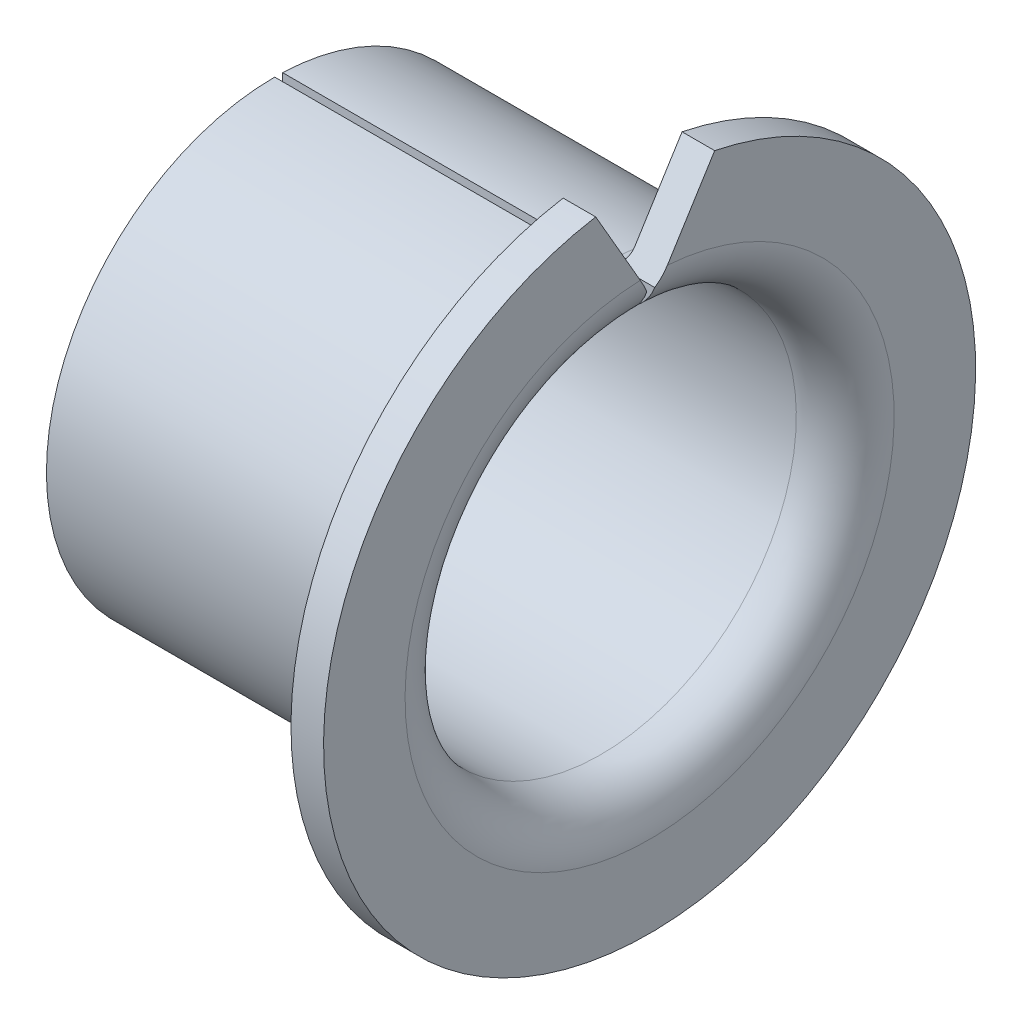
ISO-10303-21;
HEADER;
FILE_DESCRIPTION(('STEP AP214'),'2;1');
FILE_NAME('part.step','',(''),(''),'','','');
FILE_SCHEMA(('AUTOMOTIVE_DESIGN { 1 0 10303 214 1 1 1 1 }'));
ENDSEC;
DATA;
#1=APPLICATION_CONTEXT('core data for automotive mechanical design processes');
#2=APPLICATION_PROTOCOL_DEFINITION('international standard','automotive_design',2000,#1);
#3=PRODUCT_CONTEXT('',#1,'mechanical');
#4=PRODUCT('Part','Part','',(#3));
#5=PRODUCT_RELATED_PRODUCT_CATEGORY('part','',(#4));
#6=PRODUCT_DEFINITION_FORMATION('','',#4);
#7=PRODUCT_DEFINITION_CONTEXT('part definition',#1,'design');
#8=PRODUCT_DEFINITION('design','',#6,#7);
#9=PRODUCT_DEFINITION_SHAPE('','',#8);
#10=(LENGTH_UNIT() NAMED_UNIT(*) SI_UNIT(.MILLI.,.METRE.));
#11=(NAMED_UNIT(*) PLANE_ANGLE_UNIT() SI_UNIT($,.RADIAN.));
#12=(NAMED_UNIT(*) SI_UNIT($,.STERADIAN.) SOLID_ANGLE_UNIT());
#13=UNCERTAINTY_MEASURE_WITH_UNIT(LENGTH_MEASURE(1.E-05),#10,'distance_accuracy_value','');
#14=(GEOMETRIC_REPRESENTATION_CONTEXT(3) GLOBAL_UNCERTAINTY_ASSIGNED_CONTEXT((#13)) GLOBAL_UNIT_ASSIGNED_CONTEXT((#10,
#11,#12)) REPRESENTATION_CONTEXT('',''));
#15=CARTESIAN_POINT('',(0.,0.,0.));
#16=DIRECTION('',(0.,0.,1.));
#17=DIRECTION('',(1.,0.,0.));
#18=AXIS2_PLACEMENT_3D('',#15,#16,#17);
#19=CARTESIAN_POINT('',(10.,0.,0.));
#20=DIRECTION('',(-1.,0.,0.));
#21=DIRECTION('',(0.,0.,1.));
#22=AXIS2_PLACEMENT_3D('',#19,#20,#21);
#23=TOROIDAL_SURFACE('',#22,7.5,1.5);
#24=CARTESIAN_POINT('',(11.499988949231,7.5002,0.288790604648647));
#25=CARTESIAN_POINT('',(11.5001546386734,7.45775465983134,0.264284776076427));
#26=CARTESIAN_POINT('',(11.4984413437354,7.41531521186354,0.239782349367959));
#27=CARTESIAN_POINT('',(11.4913330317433,7.33090663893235,0.191049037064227));
#28=CARTESIAN_POINT('',(11.485958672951,7.28893621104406,0.166817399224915));
#29=CARTESIAN_POINT('',(11.4643997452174,7.16353320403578,0.0944159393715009));
#30=CARTESIAN_POINT('',(11.4427791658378,7.08077743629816,0.0466368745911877));
#31=CARTESIAN_POINT('',(11.4141428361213,6.99980000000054,-0.000115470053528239));
#32=B_SPLINE_CURVE_WITH_KNOTS('',3,(#24,#25,#26,#27,#28,#29,#30,#31),.UNSPECIFIED.,.F.,.F.,(4,2,
2,4),(0.,0.146975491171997,0.293128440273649,0.58601194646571),.UNSPECIFIED.);
#33=CARTESIAN_POINT('',(11.5,7.49456264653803,0.285535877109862));
#34=VERTEX_POINT('',#33);
#35=CARTESIAN_POINT('',(11.4142135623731,7.,0.));
#36=VERTEX_POINT('',#35);
#37=EDGE_CURVE('E40',#34,#36,#32,.T.);
#38=ORIENTED_EDGE('',*,*,#37,.F.);
#39=CARTESIAN_POINT('',(11.5,0.,0.));
#40=DIRECTION('',(-1.,0.,0.));
#41=DIRECTION('',(0.,0.,1.));
#42=AXIS2_PLACEMENT_3D('',#39,#40,#41);
#43=CIRCLE('',#42,7.5);
#44=CARTESIAN_POINT('',(11.5,7.48003210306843,-0.546918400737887));
#45=VERTEX_POINT('',#44);
#46=EDGE_CURVE('E113',#45,#34,#43,.T.);
#47=ORIENTED_EDGE('',*,*,#46,.F.);
#48=CARTESIAN_POINT('',(11.414141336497,6.99553578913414,-0.244171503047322));
#49=CARTESIAN_POINT('',(11.4436225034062,7.07717137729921,-0.295183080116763));
#50=CARTESIAN_POINT('',(11.4656674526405,7.16065124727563,-0.347347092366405));
#51=CARTESIAN_POINT('',(11.4872021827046,7.28714152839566,-0.426386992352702));
#52=CARTESIAN_POINT('',(11.4924588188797,7.32947172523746,-0.452837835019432));
#53=CARTESIAN_POINT('',(11.499108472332,7.41460324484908,-0.506033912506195));
#54=CARTESIAN_POINT('',(11.5004782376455,7.45740587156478,-0.532779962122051));
#55=CARTESIAN_POINT('',(11.499852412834,7.5002,-0.559520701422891));
#56=B_SPLINE_CURVE_WITH_KNOTS('',3,(#48,#49,#50,#51,#52,#53,#54,#55),.UNSPECIFIED.,.F.,.F.,(4,2,
2,4),(0.,0.301494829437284,0.451927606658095,0.60325842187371),.UNSPECIFIED.);
#57=CARTESIAN_POINT('',(11.4142135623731,6.99573578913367,-0.244296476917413));
#58=VERTEX_POINT('',#57);
#59=EDGE_CURVE('E143',#58,#45,#56,.T.);
#60=ORIENTED_EDGE('',*,*,#59,.F.);
#61=CARTESIAN_POINT('',(10.,7.49543120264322,-0.261746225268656));
#62=DIRECTION('',(0.,0.0348994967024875,0.999390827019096));
#63=DIRECTION('',(1.,0.,0.));
#64=AXIS2_PLACEMENT_3D('',#61,#62,#63);
#65=CIRCLE('',#64,1.5);
#66=CARTESIAN_POINT('',(10.,5.99634496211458,-0.209396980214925));
#67=VERTEX_POINT('',#66);
#68=EDGE_CURVE('E157',#67,#58,#65,.T.);
#69=ORIENTED_EDGE('',*,*,#68,.F.);
#70=CARTESIAN_POINT('',(10.,0.,0.));
#71=DIRECTION('',(-1.,0.,0.));
#72=DIRECTION('',(0.,0.,1.));
#73=AXIS2_PLACEMENT_3D('',#70,#71,#72);
#74=CIRCLE('',#73,6.);
#75=CARTESIAN_POINT('',(10.,6.,0.));
#76=VERTEX_POINT('',#75);
#77=EDGE_CURVE('E121',#67,#76,#74,.T.);
#78=ORIENTED_EDGE('',*,*,#77,.T.);
#79=CARTESIAN_POINT('',(10.,7.5,0.));
#80=DIRECTION('',(0.,0.,1.));
#81=DIRECTION('',(1.,0.,0.));
#82=AXIS2_PLACEMENT_3D('',#79,#80,#81);
#83=CIRCLE('',#82,1.5);
#84=EDGE_CURVE('E147',#76,#36,#83,.T.);
#85=ORIENTED_EDGE('',*,*,#84,.T.);
#86=EDGE_LOOP('',(#38,#47,#60,#69,#78,#85));
#87=FACE_BOUND('',#86,.T.);
#88=ADVANCED_FACE('F26',(#87),#23,.T.);
#89=CARTESIAN_POINT('',(11.5,9.99390827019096,-0.348994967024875));
#90=DIRECTION('',(-1.,0.,0.));
#91=DIRECTION('',(0.,0.,1.));
#92=AXIS2_PLACEMENT_3D('',#89,#90,#91);
#93=PLANE('',#92);
#94=DIRECTION('',(0.,-0.866025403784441,-0.499999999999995));
#95=VECTOR('',#94,1.);
#96=CARTESIAN_POINT('',(11.5,7.,0.));
#97=LINE('',#96,#95);
#98=CARTESIAN_POINT('',(11.5,9.86249036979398,1.65265958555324));
#99=VERTEX_POINT('',#98);
#100=EDGE_CURVE('E98',#99,#34,#97,.T.);
#101=ORIENTED_EDGE('',*,*,#100,.F.);
#102=CARTESIAN_POINT('',(11.5,0.,0.));
#103=DIRECTION('',(-1.,0.,0.));
#104=DIRECTION('',(0.,0.,1.));
#105=AXIS2_PLACEMENT_3D('',#102,#103,#104);
#106=CIRCLE('',#105,10.);
#107=CARTESIAN_POINT('',(11.5,9.79880541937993,-1.99584878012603));
#108=VERTEX_POINT('',#107);
#109=EDGE_CURVE('E111',#108,#99,#106,.T.);
#110=ORIENTED_EDGE('',*,*,#109,.F.);
#111=DIRECTION('',(0.,0.848048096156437,-0.529919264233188));
#112=VECTOR('',#111,1.);
#113=CARTESIAN_POINT('',(11.5,6.99573578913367,-0.244296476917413));
#114=LINE('',#113,#112);
#115=EDGE_CURVE('E114',#45,#108,#114,.T.);
#116=ORIENTED_EDGE('',*,*,#115,.F.);
#117=ORIENTED_EDGE('',*,*,#46,.T.);
#118=EDGE_LOOP('',(#101,#110,#116,#117));
#119=FACE_BOUND('',#118,.T.);
#120=ADVANCED_FACE('F109',(#119),#93,.F.);
#121=CARTESIAN_POINT('',(0.,0.,0.));
#122=DIRECTION('',(-1.,0.,0.));
#123=DIRECTION('',(0.,0.,1.));
#124=AXIS2_PLACEMENT_3D('',#121,#122,#123);
#125=CYLINDRICAL_SURFACE('',#124,10.);
#126=DIRECTION('',(-1.,0.,0.));
#127=VECTOR('',#126,1.);
#128=CARTESIAN_POINT('',(0.,9.86249036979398,1.65265958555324));
#129=LINE('',#128,#127);
#130=CARTESIAN_POINT('',(10.5,9.86249036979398,1.65265958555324));
#131=VERTEX_POINT('',#130);
#132=EDGE_CURVE('E95',#131,#99,#129,.F.);
#133=ORIENTED_EDGE('',*,*,#132,.F.);
#134=CARTESIAN_POINT('',(10.5,0.,0.));
#135=DIRECTION('',(-1.,0.,0.));
#136=DIRECTION('',(0.,0.,1.));
#137=AXIS2_PLACEMENT_3D('',#134,#135,#136);
#138=CIRCLE('',#137,10.);
#139=CARTESIAN_POINT('',(10.5,9.79880541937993,-1.99584878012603));
#140=VERTEX_POINT('',#139);
#141=EDGE_CURVE('E119',#140,#131,#138,.T.);
#142=ORIENTED_EDGE('',*,*,#141,.F.);
#143=DIRECTION('',(-1.,0.,0.));
#144=VECTOR('',#143,1.);
#145=CARTESIAN_POINT('',(0.,9.79880541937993,-1.99584878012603));
#146=LINE('',#145,#144);
#147=EDGE_CURVE('E118',#108,#140,#146,.T.);
#148=ORIENTED_EDGE('',*,*,#147,.F.);
#149=ORIENTED_EDGE('',*,*,#109,.T.);
#150=EDGE_LOOP('',(#133,#142,#148,#149));
#151=FACE_BOUND('',#150,.T.);
#152=ADVANCED_FACE('F117',(#151),#125,.T.);
#153=CARTESIAN_POINT('',(10.5,7.49543120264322,-0.261746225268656));
#154=DIRECTION('',(1.,0.,0.));
#155=DIRECTION('',(0.,0.,-1.));
#156=AXIS2_PLACEMENT_3D('',#153,#154,#155);
#157=PLANE('',#156);
#158=DIRECTION('',(0.,0.866025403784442,0.499999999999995));
#159=VECTOR('',#158,1.);
#160=CARTESIAN_POINT('',(10.5,7.25823396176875,0.149091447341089));
#161=LINE('',#160,#159);
#162=CARTESIAN_POINT('',(10.5,7.49456264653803,0.285535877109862));
#163=VERTEX_POINT('',#162);
#164=EDGE_CURVE('E100',#163,#131,#161,.T.);
#165=ORIENTED_EDGE('',*,*,#164,.F.);
#166=CARTESIAN_POINT('',(10.5,0.,0.));
#167=DIRECTION('',(-1.,0.,0.));
#168=DIRECTION('',(0.,0.,1.));
#169=AXIS2_PLACEMENT_3D('',#166,#167,#168);
#170=CIRCLE('',#169,7.5);
#171=CARTESIAN_POINT('',(10.5,7.48003210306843,-0.546918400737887));
#172=VERTEX_POINT('',#171);
#173=EDGE_CURVE('E123',#172,#163,#170,.T.);
#174=ORIENTED_EDGE('',*,*,#173,.F.);
#175=DIRECTION('',(0.,-0.848048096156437,0.529919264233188));
#176=VECTOR('',#175,1.);
#177=CARTESIAN_POINT('',(10.5,7.36295138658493,-0.473758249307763));
#178=LINE('',#177,#176);
#179=EDGE_CURVE('E178',#140,#172,#178,.T.);
#180=ORIENTED_EDGE('',*,*,#179,.F.);
#181=ORIENTED_EDGE('',*,*,#141,.T.);
#182=EDGE_LOOP('',(#165,#174,#180,#181));
#183=FACE_BOUND('',#182,.T.);
#184=ADVANCED_FACE('F177',(#183),#157,.F.);
#185=CARTESIAN_POINT('',(10.,0.,0.));
#186=DIRECTION('',(-1.,0.,0.));
#187=DIRECTION('',(0.,0.,1.));
#188=AXIS2_PLACEMENT_3D('',#185,#186,#187);
#189=TOROIDAL_SURFACE('',#188,7.5,0.5);
#190=CARTESIAN_POINT('',(9.9998,7.00000004,2.30940116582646E-08));
#191=CARTESIAN_POINT('',(10.0253037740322,6.9999557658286,-2.55386107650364E-05));
#192=CARTESIAN_POINT('',(10.0507781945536,7.00192858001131,0.00111346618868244));
#193=CARTESIAN_POINT('',(10.1008452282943,7.00963144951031,0.00556071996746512));
#194=CARTESIAN_POINT('',(10.1254412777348,7.01534465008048,0.00885923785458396));
#195=CARTESIAN_POINT('',(10.1731468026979,7.0302486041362,0.0174640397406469));
#196=CARTESIAN_POINT('',(10.1962576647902,7.03943605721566,0.0227684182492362));
#197=CARTESIAN_POINT('',(10.2405131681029,7.06087220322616,0.0351445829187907));
#198=CARTESIAN_POINT('',(10.261656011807,7.07312365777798,0.0422179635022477));
#199=CARTESIAN_POINT('',(10.3026632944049,7.10096232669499,0.0582906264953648));
#200=CARTESIAN_POINT('',(10.3223959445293,7.11669456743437,0.0673736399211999));
#201=CARTESIAN_POINT('',(10.3589487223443,7.15050866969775,0.0868962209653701));
#202=CARTESIAN_POINT('',(10.3757681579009,7.16859108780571,0.0973361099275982));
#203=CARTESIAN_POINT('',(10.4082661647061,7.20903080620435,0.120683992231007));
#204=CARTESIAN_POINT('',(10.4235278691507,7.23163932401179,0.133737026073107));
#205=CARTESIAN_POINT('',(10.4499935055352,7.27858501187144,0.160841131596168));
#206=CARTESIAN_POINT('',(10.4611934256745,7.30292386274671,0.174893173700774));
#207=CARTESIAN_POINT('',(10.480498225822,7.35565411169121,0.205336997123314));
#208=CARTESIAN_POINT('',(10.4880892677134,7.38418694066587,0.221810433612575));
#209=CARTESIAN_POINT('',(10.4979940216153,7.44189175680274,0.255126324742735));
#210=CARTESIAN_POINT('',(10.5003150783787,7.47106279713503,0.271968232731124));
#211=CARTESIAN_POINT('',(10.4999668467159,7.5002,0.288790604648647));
#212=B_SPLINE_CURVE_WITH_KNOTS('',3,(#190,#191,#192,#193,#194,#195,#196,#197,#198,#199,#200,
#201,#202,#203,#204,#205,#206,#207,#208,#209,#210,#211),.UNSPECIFIED.,.F.,.F.,(4,2,2,2,2,2,2,2,
2,2,4),(0.,0.0763609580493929,0.152380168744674,0.228327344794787,0.304343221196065,
0.384487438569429,0.464650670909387,0.555004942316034,0.645448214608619,0.746448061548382,
0.847307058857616),.UNSPECIFIED.);
#213=CARTESIAN_POINT('',(10.,7.,0.));
#214=VERTEX_POINT('',#213);
#215=EDGE_CURVE('E173',#214,#163,#212,.T.);
#216=ORIENTED_EDGE('',*,*,#215,.F.);
#217=CARTESIAN_POINT('',(10.,0.,0.));
#218=DIRECTION('',(-1.,0.,0.));
#219=DIRECTION('',(0.,0.,1.));
#220=AXIS2_PLACEMENT_3D('',#217,#218,#219);
#221=CIRCLE('',#220,7.);
#222=CARTESIAN_POINT('',(10.,6.99573578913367,-0.244296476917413));
#223=VERTEX_POINT('',#222);
#224=EDGE_CURVE('E164',#223,#214,#221,.T.);
#225=ORIENTED_EDGE('',*,*,#224,.F.);
#226=CARTESIAN_POINT('',(10.4995570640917,7.5002,-0.55952070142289));
#227=CARTESIAN_POINT('',(10.5008895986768,7.46999372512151,-0.540645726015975));
#228=CARTESIAN_POINT('',(10.4992247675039,7.43968930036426,-0.521709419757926));
#229=CARTESIAN_POINT('',(10.4899775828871,7.37965443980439,-0.484195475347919));
#230=CARTESIAN_POINT('',(10.482379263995,7.34992577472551,-0.465618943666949));
#231=CARTESIAN_POINT('',(10.4613242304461,7.29195252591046,-0.429393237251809));
#232=CARTESIAN_POINT('',(10.4478609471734,7.26370964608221,-0.411745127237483));
#233=CARTESIAN_POINT('',(10.4152284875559,7.20970885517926,-0.378001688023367));
#234=CARTESIAN_POINT('',(10.3960642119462,7.18394883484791,-0.361905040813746));
#235=CARTESIAN_POINT('',(10.3535175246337,7.13729934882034,-0.332755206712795));
#236=CARTESIAN_POINT('',(10.3304275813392,7.1162191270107,-0.319582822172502));
#237=CARTESIAN_POINT('',(10.2798413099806,7.07825073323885,-0.295857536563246));
#238=CARTESIAN_POINT('',(10.2523481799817,7.06135954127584,-0.285302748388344));
#239=CARTESIAN_POINT('',(10.1976151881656,7.03470319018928,-0.268646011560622));
#240=CARTESIAN_POINT('',(10.1708096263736,7.02429608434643,-0.262142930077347));
#241=CARTESIAN_POINT('',(10.1153511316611,7.0081054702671,-0.25202591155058));
#242=CARTESIAN_POINT('',(10.0867034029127,7.0023095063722,-0.248404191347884));
#243=CARTESIAN_POINT('',(10.0481078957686,6.99791429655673,-0.24565775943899));
#244=CARTESIAN_POINT('',(10.0384654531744,6.99709432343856,-0.245145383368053));
#245=CARTESIAN_POINT('',(10.01915045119,6.99600391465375,-0.244464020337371));
#246=CARTESIAN_POINT('',(10.0094779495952,6.99573274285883,-0.244294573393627));
#247=CARTESIAN_POINT('',(9.9998,6.99573582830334,-0.244296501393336));
#248=B_SPLINE_CURVE_WITH_KNOTS('',3,(#226,#227,#228,#229,#230,#231,#232,#233,#234,#235,#236,
#237,#238,#239,#240,#241,#242,#243,#244,#245,#246,#247),.UNSPECIFIED.,.F.,.F.,(4,2,2,2,2,2,2,2,
2,2,4),(0.,0.106815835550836,0.213920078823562,0.321144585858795,0.428277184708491,
0.529475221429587,0.630600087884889,0.71854077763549,0.806243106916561,0.835299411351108,
0.864316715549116),.UNSPECIFIED.);
#249=EDGE_CURVE('E174',#172,#223,#248,.T.);
#250=ORIENTED_EDGE('',*,*,#249,.F.);
#251=ORIENTED_EDGE('',*,*,#173,.T.);
#252=EDGE_LOOP('',(#216,#225,#250,#251));
#253=FACE_BOUND('',#252,.T.);
#254=ADVANCED_FACE('F171',(#253),#189,.F.);
#255=CARTESIAN_POINT('',(10.,7.49543120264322,-0.261746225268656));
#256=DIRECTION('',(0.,0.0348994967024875,0.999390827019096));
#257=DIRECTION('',(1.,0.,0.));
#258=AXIS2_PLACEMENT_3D('',#255,#256,#257);
#259=PLANE('',#258);
#260=ORIENTED_EDGE('',*,*,#68,.T.);
#261=DIRECTION('',(-1.,0.,0.));
#262=VECTOR('',#261,1.);
#263=CARTESIAN_POINT('',(11.5,6.99573578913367,-0.244296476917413));
#264=LINE('',#263,#262);
#265=EDGE_CURVE('E180',#58,#223,#264,.T.);
#266=ORIENTED_EDGE('',*,*,#265,.T.);
#267=DIRECTION('',(-1.,0.,0.));
#268=VECTOR('',#267,1.);
#269=CARTESIAN_POINT('',(0.,6.99573578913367,-0.244296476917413));
#270=LINE('',#269,#268);
#271=CARTESIAN_POINT('',(0.,6.99573578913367,-0.244296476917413));
#272=VERTEX_POINT('',#271);
#273=EDGE_CURVE('E160',#223,#272,#270,.T.);
#274=ORIENTED_EDGE('',*,*,#273,.T.);
#275=DIRECTION('',(0.,-0.999390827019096,0.0348994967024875));
#276=VECTOR('',#275,1.);
#277=CARTESIAN_POINT('',(0.,6.99573578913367,-0.244296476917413));
#278=LINE('',#277,#276);
#279=CARTESIAN_POINT('',(0.,5.99634496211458,-0.209396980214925));
#280=VERTEX_POINT('',#279);
#281=EDGE_CURVE('E154',#272,#280,#278,.T.);
#282=ORIENTED_EDGE('',*,*,#281,.T.);
#283=DIRECTION('',(1.,0.,0.));
#284=VECTOR('',#283,1.);
#285=CARTESIAN_POINT('',(0.,5.99634496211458,-0.209396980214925));
#286=LINE('',#285,#284);
#287=EDGE_CURVE('E135',#280,#67,#286,.T.);
#288=ORIENTED_EDGE('',*,*,#287,.T.);
#289=EDGE_LOOP('',(#260,#266,#274,#282,#288));
#290=FACE_BOUND('',#289,.T.);
#291=ADVANCED_FACE('F209',(#290),#259,.T.);
#292=CARTESIAN_POINT('',(10.,7.5,0.));
#293=DIRECTION('',(0.,0.,1.));
#294=DIRECTION('',(1.,0.,0.));
#295=AXIS2_PLACEMENT_3D('',#292,#293,#294);
#296=PLANE('',#295);
#297=DIRECTION('',(-1.,0.,0.));
#298=VECTOR('',#297,1.);
#299=CARTESIAN_POINT('',(10.,7.,0.));
#300=LINE('',#299,#298);
#301=EDGE_CURVE('E11',#36,#214,#300,.T.);
#302=ORIENTED_EDGE('',*,*,#301,.F.);
#303=ORIENTED_EDGE('',*,*,#84,.F.);
#304=DIRECTION('',(1.,0.,0.));
#305=VECTOR('',#304,1.);
#306=CARTESIAN_POINT('',(0.,6.,0.));
#307=LINE('',#306,#305);
#308=CARTESIAN_POINT('',(0.,6.,0.));
#309=VERTEX_POINT('',#308);
#310=EDGE_CURVE('E132',#309,#76,#307,.T.);
#311=ORIENTED_EDGE('',*,*,#310,.F.);
#312=DIRECTION('',(0.,-1.,0.));
#313=VECTOR('',#312,1.);
#314=CARTESIAN_POINT('',(0.,7.,0.));
#315=LINE('',#314,#313);
#316=CARTESIAN_POINT('',(0.,7.,0.));
#317=VERTEX_POINT('',#316);
#318=EDGE_CURVE('E139',#317,#309,#315,.T.);
#319=ORIENTED_EDGE('',*,*,#318,.F.);
#320=DIRECTION('',(-1.,0.,0.));
#321=VECTOR('',#320,1.);
#322=CARTESIAN_POINT('',(0.,7.,0.));
#323=LINE('',#322,#321);
#324=EDGE_CURVE('E149',#214,#317,#323,.T.);
#325=ORIENTED_EDGE('',*,*,#324,.F.);
#326=EDGE_LOOP('',(#302,#303,#311,#319,#325));
#327=FACE_BOUND('',#326,.T.);
#328=ADVANCED_FACE('F145',(#327),#296,.F.);
#329=CARTESIAN_POINT('',(0.,6.99573578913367,-0.244296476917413));
#330=DIRECTION('',(1.,0.,0.));
#331=DIRECTION('',(0.,0.,-1.));
#332=AXIS2_PLACEMENT_3D('',#329,#330,#331);
#333=PLANE('',#332);
#334=CARTESIAN_POINT('',(0.,0.,0.));
#335=DIRECTION('',(-1.,0.,0.));
#336=DIRECTION('',(0.,0.,1.));
#337=AXIS2_PLACEMENT_3D('',#334,#335,#336);
#338=CIRCLE('',#337,6.);
#339=EDGE_CURVE('E34',#280,#309,#338,.T.);
#340=ORIENTED_EDGE('',*,*,#339,.F.);
#341=ORIENTED_EDGE('',*,*,#281,.F.);
#342=CARTESIAN_POINT('',(0.,0.,0.));
#343=DIRECTION('',(-1.,0.,0.));
#344=DIRECTION('',(0.,0.,1.));
#345=AXIS2_PLACEMENT_3D('',#342,#343,#344);
#346=CIRCLE('',#345,7.);
#347=EDGE_CURVE('E48',#272,#317,#346,.T.);
#348=ORIENTED_EDGE('',*,*,#347,.T.);
#349=ORIENTED_EDGE('',*,*,#318,.T.);
#350=EDGE_LOOP('',(#340,#341,#348,#349));
#351=FACE_BOUND('',#350,.T.);
#352=ADVANCED_FACE('F140',(#351),#333,.F.);
#353=CARTESIAN_POINT('',(0.,0.,0.));
#354=DIRECTION('',(-1.,0.,0.));
#355=DIRECTION('',(0.,0.,1.));
#356=AXIS2_PLACEMENT_3D('',#353,#354,#355);
#357=CYLINDRICAL_SURFACE('',#356,6.);
#358=ORIENTED_EDGE('',*,*,#77,.F.);
#359=ORIENTED_EDGE('',*,*,#287,.F.);
#360=ORIENTED_EDGE('',*,*,#339,.T.);
#361=ORIENTED_EDGE('',*,*,#310,.T.);
#362=EDGE_LOOP('',(#358,#359,#360,#361));
#363=FACE_BOUND('',#362,.T.);
#364=ADVANCED_FACE('F28',(#363),#357,.F.);
#365=CARTESIAN_POINT('',(0.,0.,0.));
#366=DIRECTION('',(-1.,0.,0.));
#367=DIRECTION('',(0.,0.,1.));
#368=AXIS2_PLACEMENT_3D('',#365,#366,#367);
#369=CYLINDRICAL_SURFACE('',#368,7.);
#370=ORIENTED_EDGE('',*,*,#273,.F.);
#371=ORIENTED_EDGE('',*,*,#224,.T.);
#372=ORIENTED_EDGE('',*,*,#324,.T.);
#373=ORIENTED_EDGE('',*,*,#347,.F.);
#374=EDGE_LOOP('',(#370,#371,#372,#373));
#375=FACE_BOUND('',#374,.T.);
#376=ADVANCED_FACE('F204',(#375),#369,.T.);
#377=CARTESIAN_POINT('',(11.5,7.,0.));
#378=DIRECTION('',(0.,0.499999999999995,-0.866025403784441));
#379=DIRECTION('',(0.,0.866025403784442,0.499999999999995));
#380=AXIS2_PLACEMENT_3D('',#377,#378,#379);
#381=PLANE('',#380);
#382=ORIENTED_EDGE('',*,*,#37,.T.);
#383=ORIENTED_EDGE('',*,*,#301,.T.);
#384=ORIENTED_EDGE('',*,*,#215,.T.);
#385=ORIENTED_EDGE('',*,*,#164,.T.);
#386=ORIENTED_EDGE('',*,*,#132,.T.);
#387=ORIENTED_EDGE('',*,*,#100,.T.);
#388=EDGE_LOOP('',(#382,#383,#384,#385,#386,#387));
#389=FACE_BOUND('',#388,.T.);
#390=ADVANCED_FACE('F97',(#389),#381,.T.);
#391=CARTESIAN_POINT('',(11.5,6.99573578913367,-0.244296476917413));
#392=DIRECTION('',(0.,0.529919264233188,0.848048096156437));
#393=DIRECTION('',(0.,-0.848048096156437,0.529919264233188));
#394=AXIS2_PLACEMENT_3D('',#391,#392,#393);
#395=PLANE('',#394);
#396=ORIENTED_EDGE('',*,*,#59,.T.);
#397=ORIENTED_EDGE('',*,*,#115,.T.);
#398=ORIENTED_EDGE('',*,*,#147,.T.);
#399=ORIENTED_EDGE('',*,*,#179,.T.);
#400=ORIENTED_EDGE('',*,*,#249,.T.);
#401=ORIENTED_EDGE('',*,*,#265,.F.);
#402=EDGE_LOOP('',(#396,#397,#398,#399,#400,#401));
#403=FACE_BOUND('',#402,.T.);
#404=ADVANCED_FACE('F203',(#403),#395,.T.);
#405=CLOSED_SHELL('',(#88,#120,#152,#184,#254,#291,#328,#352,#364,#376,#390,#404));
#406=MANIFOLD_SOLID_BREP('B2',#405);
#407=ADVANCED_BREP_SHAPE_REPRESENTATION('',(#18,#406),#14);
#408=SHAPE_DEFINITION_REPRESENTATION(#9,#407);
ENDSEC;
END-ISO-10303-21;
